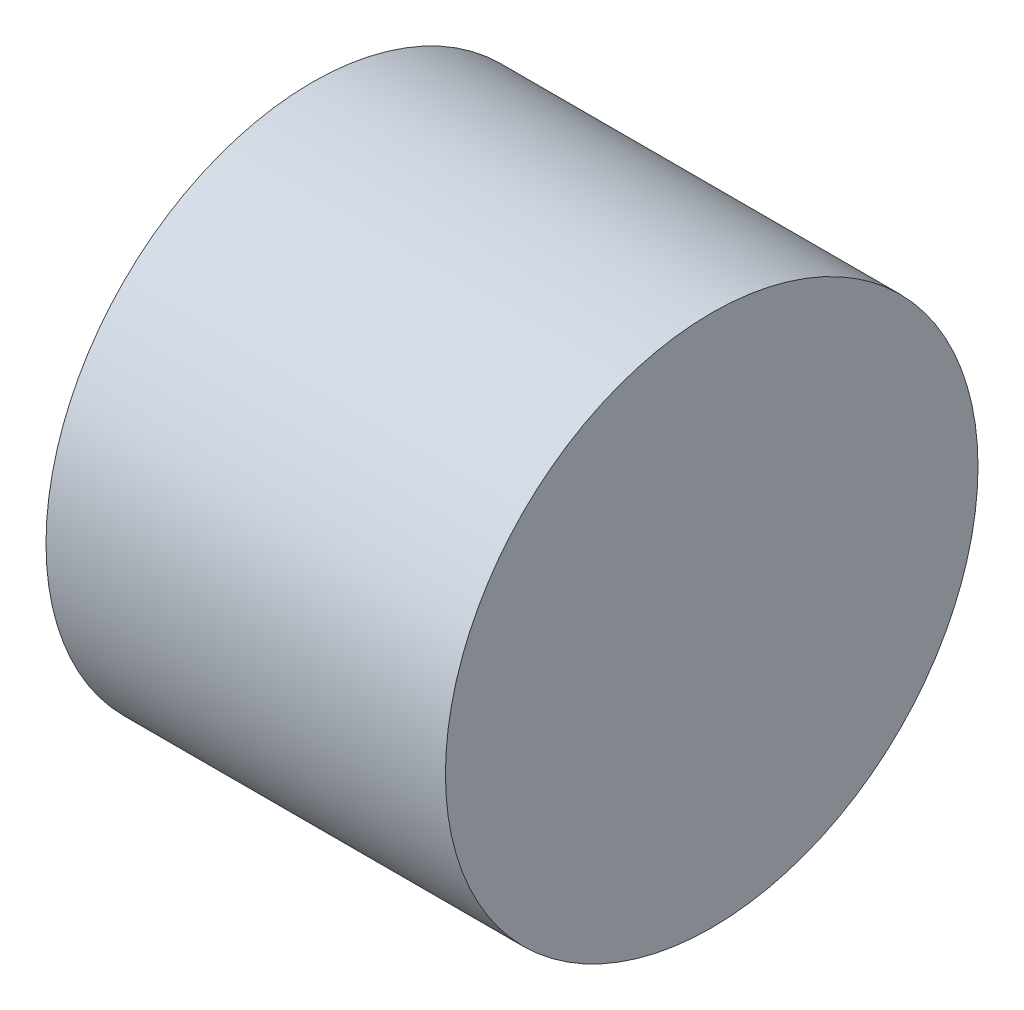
from build123d import *

# Parameters (mm, degrees)
ESQUISSE2_W = 60
ESQUISSE2_H = 40


with BuildPart() as part:
    # Esquisse2 → R_volution1 (revolve)
    with BuildSketch(Plane.XY, mode=Mode.PRIVATE) as r_volution1_sk:
        with Locations((30, 20)):
            Rectangle(ESQUISSE2_W, ESQUISSE2_H)
    revolve(r_volution1_sk.sketch.rotate(Axis((-39.971867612, 0, 0), (1, 0, 0)), 90), axis=Axis((-39.971867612, 0, 0), (1, 0, 0)))


solid = part.part
